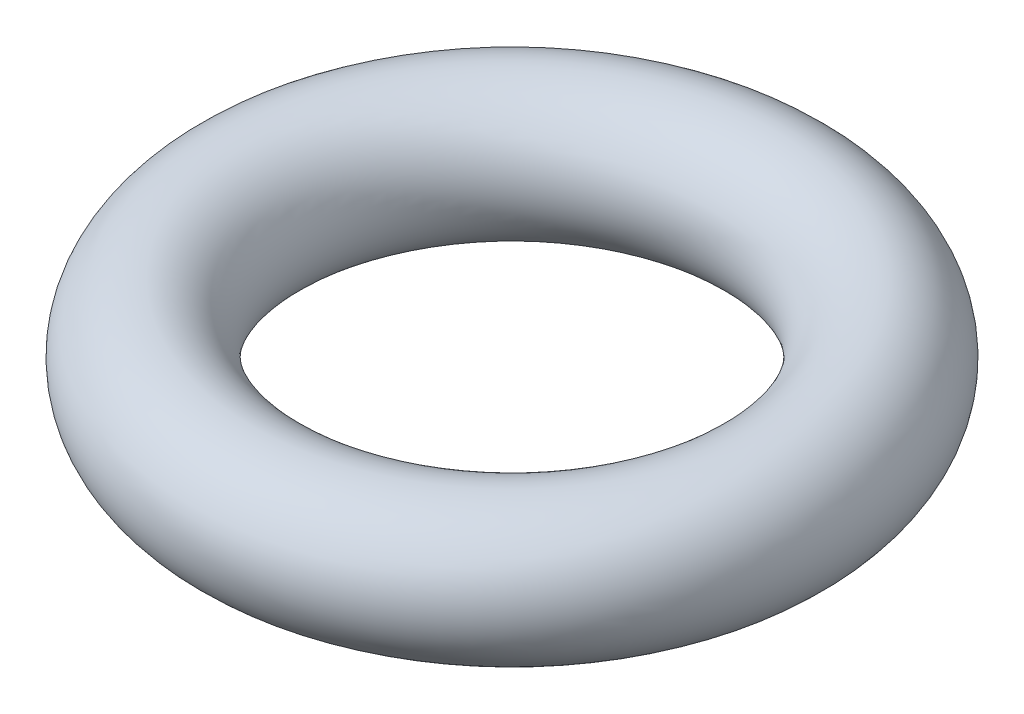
ISO-10303-21;
HEADER;
FILE_DESCRIPTION(('STEP AP214'),'2;1');
FILE_NAME('part.step','',(''),(''),'','','');
FILE_SCHEMA(('AUTOMOTIVE_DESIGN { 1 0 10303 214 1 1 1 1 }'));
ENDSEC;
DATA;
#1=APPLICATION_CONTEXT('core data for automotive mechanical design processes');
#2=APPLICATION_PROTOCOL_DEFINITION('international standard','automotive_design',2000,#1);
#3=PRODUCT_CONTEXT('',#1,'mechanical');
#4=PRODUCT('Part','Part','',(#3));
#5=PRODUCT_RELATED_PRODUCT_CATEGORY('part','',(#4));
#6=PRODUCT_DEFINITION_FORMATION('','',#4);
#7=PRODUCT_DEFINITION_CONTEXT('part definition',#1,'design');
#8=PRODUCT_DEFINITION('design','',#6,#7);
#9=PRODUCT_DEFINITION_SHAPE('','',#8);
#10=(LENGTH_UNIT() NAMED_UNIT(*) SI_UNIT(.MILLI.,.METRE.));
#11=(NAMED_UNIT(*) PLANE_ANGLE_UNIT() SI_UNIT($,.RADIAN.));
#12=(NAMED_UNIT(*) SI_UNIT($,.STERADIAN.) SOLID_ANGLE_UNIT());
#13=UNCERTAINTY_MEASURE_WITH_UNIT(LENGTH_MEASURE(1.E-05),#10,'distance_accuracy_value','');
#14=(GEOMETRIC_REPRESENTATION_CONTEXT(3) GLOBAL_UNCERTAINTY_ASSIGNED_CONTEXT((#13)) GLOBAL_UNIT_ASSIGNED_CONTEXT((#10,
#11,#12)) REPRESENTATION_CONTEXT('',''));
#15=CARTESIAN_POINT('',(0.,0.,0.));
#16=DIRECTION('',(0.,0.,1.));
#17=DIRECTION('',(1.,0.,0.));
#18=AXIS2_PLACEMENT_3D('',#15,#16,#17);
#19=CARTESIAN_POINT('',(0.,0.,0.));
#20=DIRECTION('',(0.,-1.,0.));
#21=DIRECTION('',(0.,0.,-1.));
#22=AXIS2_PLACEMENT_3D('',#19,#20,#21);
#23=TOROIDAL_SURFACE('',#22,9.5,2.5);
#24=CARTESIAN_POINT('',(0.,0.,-12.));
#25=VERTEX_POINT('',#24);
#26=VERTEX_LOOP('',#25);
#27=FACE_BOUND('',#26,.T.);
#28=ADVANCED_FACE('F29',(#27),#23,.T.);
#29=CLOSED_SHELL('',(#28));
#30=MANIFOLD_SOLID_BREP('B2',#29);
#31=ADVANCED_BREP_SHAPE_REPRESENTATION('',(#18,#30),#14);
#32=SHAPE_DEFINITION_REPRESENTATION(#9,#31);
ENDSEC;
END-ISO-10303-21;
